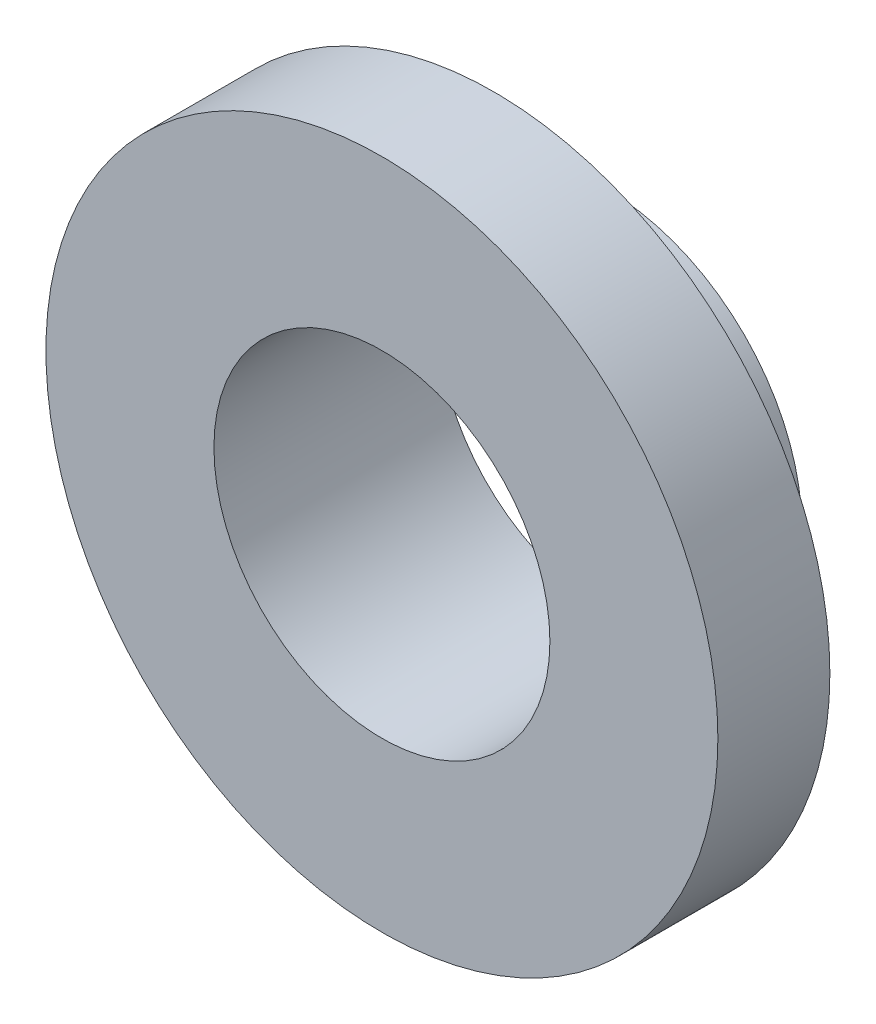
ISO-10303-21;
HEADER;
FILE_DESCRIPTION(('STEP AP214'),'2;1');
FILE_NAME('part.step','',(''),(''),'','','');
FILE_SCHEMA(('AUTOMOTIVE_DESIGN { 1 0 10303 214 1 1 1 1 }'));
ENDSEC;
DATA;
#1=APPLICATION_CONTEXT('core data for automotive mechanical design processes');
#2=APPLICATION_PROTOCOL_DEFINITION('international standard','automotive_design',2000,#1);
#3=PRODUCT_CONTEXT('',#1,'mechanical');
#4=PRODUCT('Part','Part','',(#3));
#5=PRODUCT_RELATED_PRODUCT_CATEGORY('part','',(#4));
#6=PRODUCT_DEFINITION_FORMATION('','',#4);
#7=PRODUCT_DEFINITION_CONTEXT('part definition',#1,'design');
#8=PRODUCT_DEFINITION('design','',#6,#7);
#9=PRODUCT_DEFINITION_SHAPE('','',#8);
#10=(LENGTH_UNIT() NAMED_UNIT(*) SI_UNIT(.MILLI.,.METRE.));
#11=(NAMED_UNIT(*) PLANE_ANGLE_UNIT() SI_UNIT($,.RADIAN.));
#12=(NAMED_UNIT(*) SI_UNIT($,.STERADIAN.) SOLID_ANGLE_UNIT());
#13=UNCERTAINTY_MEASURE_WITH_UNIT(LENGTH_MEASURE(1.E-05),#10,'distance_accuracy_value','');
#14=(GEOMETRIC_REPRESENTATION_CONTEXT(3) GLOBAL_UNCERTAINTY_ASSIGNED_CONTEXT((#13)) GLOBAL_UNIT_ASSIGNED_CONTEXT((#10,
#11,#12)) REPRESENTATION_CONTEXT('',''));
#15=CARTESIAN_POINT('',(0.,0.,0.));
#16=DIRECTION('',(0.,0.,1.));
#17=DIRECTION('',(1.,0.,0.));
#18=AXIS2_PLACEMENT_3D('',#15,#16,#17);
#19=CARTESIAN_POINT('',(0.,0.,0.));
#20=DIRECTION('',(0.,0.,1.));
#21=DIRECTION('',(1.,0.,0.));
#22=AXIS2_PLACEMENT_3D('',#19,#20,#21);
#23=PLANE('',#22);
#24=CARTESIAN_POINT('',(0.,0.,0.));
#25=DIRECTION('',(0.,0.,1.));
#26=DIRECTION('',(1.,0.,0.));
#27=AXIS2_PLACEMENT_3D('',#24,#25,#26);
#28=CIRCLE('',#27,3.);
#29=CARTESIAN_POINT('',(3.,0.,0.));
#30=VERTEX_POINT('',#29);
#31=EDGE_CURVE('E42',#30,#30,#28,.T.);
#32=ORIENTED_EDGE('',*,*,#31,.F.);
#33=EDGE_LOOP('',(#32));
#34=FACE_BOUND('',#33,.T.);
#35=CARTESIAN_POINT('',(0.,0.,0.));
#36=DIRECTION('',(0.,0.,1.));
#37=DIRECTION('',(1.,0.,0.));
#38=AXIS2_PLACEMENT_3D('',#35,#36,#37);
#39=CIRCLE('',#38,1.75);
#40=CARTESIAN_POINT('',(1.75,0.,0.));
#41=VERTEX_POINT('',#40);
#42=EDGE_CURVE('E10',#41,#41,#39,.F.);
#43=ORIENTED_EDGE('',*,*,#42,.F.);
#44=EDGE_LOOP('',(#43));
#45=FACE_BOUND('',#44,.T.);
#46=ADVANCED_FACE('F31',(#34,#45),#23,.F.);
#47=CARTESIAN_POINT('',(0.,0.,1.));
#48=DIRECTION('',(0.,0.,-1.));
#49=DIRECTION('',(-1.,0.,0.));
#50=AXIS2_PLACEMENT_3D('',#47,#48,#49);
#51=CYLINDRICAL_SURFACE('',#50,3.);
#52=CARTESIAN_POINT('',(0.,0.,1.));
#53=DIRECTION('',(0.,0.,1.));
#54=DIRECTION('',(1.,0.,0.));
#55=AXIS2_PLACEMENT_3D('',#52,#53,#54);
#56=CIRCLE('',#55,3.);
#57=CARTESIAN_POINT('',(3.,0.,1.));
#58=VERTEX_POINT('',#57);
#59=EDGE_CURVE('E38',#58,#58,#56,.T.);
#60=ORIENTED_EDGE('',*,*,#59,.F.);
#61=EDGE_LOOP('',(#60));
#62=FACE_BOUND('',#61,.T.);
#63=ORIENTED_EDGE('',*,*,#31,.T.);
#64=EDGE_LOOP('',(#63));
#65=FACE_BOUND('',#64,.T.);
#66=ADVANCED_FACE('F33',(#62,#65),#51,.T.);
#67=CARTESIAN_POINT('',(0.,0.,1.));
#68=DIRECTION('',(0.,0.,1.));
#69=DIRECTION('',(1.,0.,0.));
#70=AXIS2_PLACEMENT_3D('',#67,#68,#69);
#71=PLANE('',#70);
#72=CARTESIAN_POINT('',(0.,0.,1.));
#73=DIRECTION('',(0.,0.,1.));
#74=DIRECTION('',(1.,0.,0.));
#75=AXIS2_PLACEMENT_3D('',#72,#73,#74);
#76=CIRCLE('',#75,1.5);
#77=CARTESIAN_POINT('',(1.5,0.,1.));
#78=VERTEX_POINT('',#77);
#79=EDGE_CURVE('E51',#78,#78,#76,.F.);
#80=ORIENTED_EDGE('',*,*,#79,.T.);
#81=EDGE_LOOP('',(#80));
#82=FACE_BOUND('',#81,.T.);
#83=ORIENTED_EDGE('',*,*,#59,.T.);
#84=EDGE_LOOP('',(#83));
#85=FACE_BOUND('',#84,.T.);
#86=ADVANCED_FACE('F69',(#82,#85),#71,.T.);
#87=CARTESIAN_POINT('',(0.,0.,-1.));
#88=DIRECTION('',(0.,0.,1.));
#89=DIRECTION('',(1.,0.,0.));
#90=AXIS2_PLACEMENT_3D('',#87,#88,#89);
#91=CYLINDRICAL_SURFACE('',#90,1.75);
#92=CARTESIAN_POINT('',(0.,0.,-1.));
#93=DIRECTION('',(0.,0.,-1.));
#94=DIRECTION('',(-1.,0.,0.));
#95=AXIS2_PLACEMENT_3D('',#92,#93,#94);
#96=CIRCLE('',#95,1.75);
#97=CARTESIAN_POINT('',(-1.75,0.,-1.));
#98=VERTEX_POINT('',#97);
#99=EDGE_CURVE('E47',#98,#98,#96,.T.);
#100=ORIENTED_EDGE('',*,*,#99,.F.);
#101=EDGE_LOOP('',(#100));
#102=FACE_BOUND('',#101,.T.);
#103=ORIENTED_EDGE('',*,*,#42,.T.);
#104=EDGE_LOOP('',(#103));
#105=FACE_BOUND('',#104,.T.);
#106=ADVANCED_FACE('F64',(#102,#105),#91,.T.);
#107=CARTESIAN_POINT('',(0.,0.,-1.));
#108=DIRECTION('',(0.,0.,-1.));
#109=DIRECTION('',(-1.,0.,0.));
#110=AXIS2_PLACEMENT_3D('',#107,#108,#109);
#111=PLANE('',#110);
#112=CARTESIAN_POINT('',(0.,0.,-1.));
#113=DIRECTION('',(0.,0.,-1.));
#114=DIRECTION('',(-1.,0.,0.));
#115=AXIS2_PLACEMENT_3D('',#112,#113,#114);
#116=CIRCLE('',#115,1.5);
#117=CARTESIAN_POINT('',(-1.5,0.,-1.));
#118=VERTEX_POINT('',#117);
#119=EDGE_CURVE('E54',#118,#118,#116,.T.);
#120=ORIENTED_EDGE('',*,*,#119,.F.);
#121=EDGE_LOOP('',(#120));
#122=FACE_BOUND('',#121,.T.);
#123=ORIENTED_EDGE('',*,*,#99,.T.);
#124=EDGE_LOOP('',(#123));
#125=FACE_BOUND('',#124,.T.);
#126=ADVANCED_FACE('F61',(#122,#125),#111,.T.);
#127=CARTESIAN_POINT('',(0.,0.,5.24264068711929));
#128=DIRECTION('',(0.,0.,-1.));
#129=DIRECTION('',(-1.,0.,0.));
#130=AXIS2_PLACEMENT_3D('',#127,#128,#129);
#131=CYLINDRICAL_SURFACE('',#130,1.5);
#132=ORIENTED_EDGE('',*,*,#119,.T.);
#133=EDGE_LOOP('',(#132));
#134=FACE_BOUND('',#133,.T.);
#135=ORIENTED_EDGE('',*,*,#79,.F.);
#136=EDGE_LOOP('',(#135));
#137=FACE_BOUND('',#136,.T.);
#138=ADVANCED_FACE('F58',(#134,#137),#131,.F.);
#139=CLOSED_SHELL('',(#46,#66,#86,#106,#126,#138));
#140=MANIFOLD_SOLID_BREP('B2',#139);
#141=ADVANCED_BREP_SHAPE_REPRESENTATION('',(#18,#140),#14);
#142=SHAPE_DEFINITION_REPRESENTATION(#9,#141);
ENDSEC;
END-ISO-10303-21;
